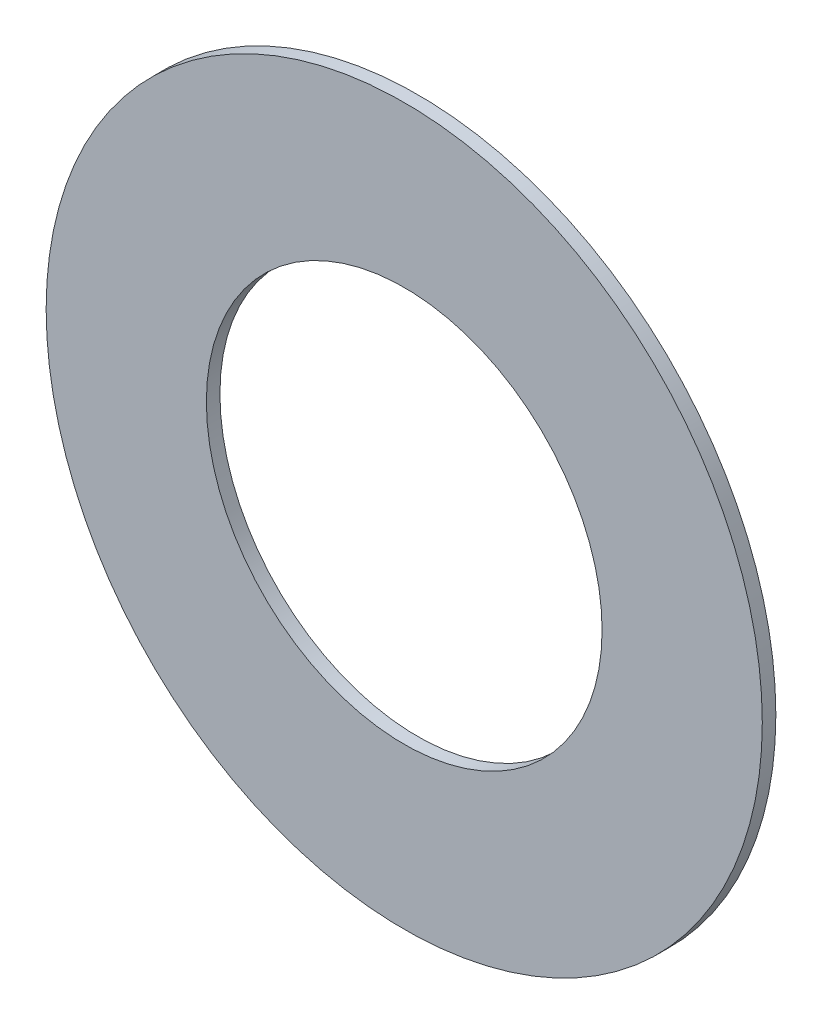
ISO-10303-21;
HEADER;
FILE_DESCRIPTION(('STEP AP214'),'2;1');
FILE_NAME('part.step','',(''),(''),'','','');
FILE_SCHEMA(('AUTOMOTIVE_DESIGN { 1 0 10303 214 1 1 1 1 }'));
ENDSEC;
DATA;
#1=APPLICATION_CONTEXT('core data for automotive mechanical design processes');
#2=APPLICATION_PROTOCOL_DEFINITION('international standard','automotive_design',2000,#1);
#3=PRODUCT_CONTEXT('',#1,'mechanical');
#4=PRODUCT('Part','Part','',(#3));
#5=PRODUCT_RELATED_PRODUCT_CATEGORY('part','',(#4));
#6=PRODUCT_DEFINITION_FORMATION('','',#4);
#7=PRODUCT_DEFINITION_CONTEXT('part definition',#1,'design');
#8=PRODUCT_DEFINITION('design','',#6,#7);
#9=PRODUCT_DEFINITION_SHAPE('','',#8);
#10=(LENGTH_UNIT() NAMED_UNIT(*) SI_UNIT(.MILLI.,.METRE.));
#11=(NAMED_UNIT(*) PLANE_ANGLE_UNIT() SI_UNIT($,.RADIAN.));
#12=(NAMED_UNIT(*) SI_UNIT($,.STERADIAN.) SOLID_ANGLE_UNIT());
#13=UNCERTAINTY_MEASURE_WITH_UNIT(LENGTH_MEASURE(1.E-05),#10,'distance_accuracy_value','');
#14=(GEOMETRIC_REPRESENTATION_CONTEXT(3) GLOBAL_UNCERTAINTY_ASSIGNED_CONTEXT((#13)) GLOBAL_UNIT_ASSIGNED_CONTEXT((#10,
#11,#12)) REPRESENTATION_CONTEXT('',''));
#15=CARTESIAN_POINT('',(0.,0.,0.));
#16=DIRECTION('',(0.,0.,1.));
#17=DIRECTION('',(1.,0.,0.));
#18=AXIS2_PLACEMENT_3D('',#15,#16,#17);
#19=CARTESIAN_POINT('',(0.,0.,1.5875));
#20=DIRECTION('',(0.,0.,1.));
#21=DIRECTION('',(1.,0.,0.));
#22=AXIS2_PLACEMENT_3D('',#19,#20,#21);
#23=PLANE('',#22);
#24=CARTESIAN_POINT('',(0.,0.,1.5875));
#25=DIRECTION('',(0.,0.,1.));
#26=DIRECTION('',(1.,0.,0.));
#27=AXIS2_PLACEMENT_3D('',#24,#25,#26);
#28=CIRCLE('',#27,83.8895845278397);
#29=CARTESIAN_POINT('',(83.8895845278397,0.,1.5875));
#30=VERTEX_POINT('',#29);
#31=EDGE_CURVE('E10',#30,#30,#28,.T.);
#32=ORIENTED_EDGE('',*,*,#31,.T.);
#33=EDGE_LOOP('',(#32));
#34=FACE_BOUND('',#33,.T.);
#35=CARTESIAN_POINT('',(0.,0.,1.5875));
#36=DIRECTION('',(0.,0.,1.));
#37=DIRECTION('',(1.,0.,0.));
#38=AXIS2_PLACEMENT_3D('',#35,#36,#37);
#39=CIRCLE('',#38,46.355);
#40=CARTESIAN_POINT('',(46.355,0.,1.5875));
#41=VERTEX_POINT('',#40);
#42=EDGE_CURVE('E57',#41,#41,#39,.T.);
#43=ORIENTED_EDGE('',*,*,#42,.F.);
#44=EDGE_LOOP('',(#43));
#45=FACE_BOUND('',#44,.T.);
#46=ADVANCED_FACE('F43',(#34,#45),#23,.T.);
#47=CARTESIAN_POINT('',(0.,0.,-1.5875));
#48=DIRECTION('',(0.,0.,1.));
#49=DIRECTION('',(1.,0.,0.));
#50=AXIS2_PLACEMENT_3D('',#47,#48,#49);
#51=PLANE('',#50);
#52=CARTESIAN_POINT('',(0.,0.,-1.5875));
#53=DIRECTION('',(0.,0.,1.));
#54=DIRECTION('',(1.,0.,0.));
#55=AXIS2_PLACEMENT_3D('',#52,#53,#54);
#56=CIRCLE('',#55,83.8895845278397);
#57=CARTESIAN_POINT('',(83.8895845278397,0.,-1.5875));
#58=VERTEX_POINT('',#57);
#59=EDGE_CURVE('E50',#58,#58,#56,.T.);
#60=ORIENTED_EDGE('',*,*,#59,.F.);
#61=EDGE_LOOP('',(#60));
#62=FACE_BOUND('',#61,.T.);
#63=CARTESIAN_POINT('',(0.,0.,-1.5875));
#64=DIRECTION('',(0.,0.,1.));
#65=DIRECTION('',(1.,0.,0.));
#66=AXIS2_PLACEMENT_3D('',#63,#64,#65);
#67=CIRCLE('',#66,46.355);
#68=CARTESIAN_POINT('',(46.355,0.,-1.5875));
#69=VERTEX_POINT('',#68);
#70=EDGE_CURVE('E59',#69,#69,#67,.T.);
#71=ORIENTED_EDGE('',*,*,#70,.T.);
#72=EDGE_LOOP('',(#71));
#73=FACE_BOUND('',#72,.T.);
#74=ADVANCED_FACE('F67',(#62,#73),#51,.F.);
#75=CARTESIAN_POINT('',(0.,0.,1.5875));
#76=DIRECTION('',(0.,0.,-1.));
#77=DIRECTION('',(-1.,0.,0.));
#78=AXIS2_PLACEMENT_3D('',#75,#76,#77);
#79=CYLINDRICAL_SURFACE('',#78,83.8895845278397);
#80=ORIENTED_EDGE('',*,*,#31,.F.);
#81=EDGE_LOOP('',(#80));
#82=FACE_BOUND('',#81,.T.);
#83=ORIENTED_EDGE('',*,*,#59,.T.);
#84=EDGE_LOOP('',(#83));
#85=FACE_BOUND('',#84,.T.);
#86=ADVANCED_FACE('F44',(#82,#85),#79,.T.);
#87=CARTESIAN_POINT('',(0.,0.,1.5875));
#88=DIRECTION('',(0.,0.,-1.));
#89=DIRECTION('',(-1.,0.,0.));
#90=AXIS2_PLACEMENT_3D('',#87,#88,#89);
#91=CYLINDRICAL_SURFACE('',#90,46.355);
#92=ORIENTED_EDGE('',*,*,#42,.T.);
#93=EDGE_LOOP('',(#92));
#94=FACE_BOUND('',#93,.T.);
#95=ORIENTED_EDGE('',*,*,#70,.F.);
#96=EDGE_LOOP('',(#95));
#97=FACE_BOUND('',#96,.T.);
#98=ADVANCED_FACE('F68',(#94,#97),#91,.F.);
#99=CLOSED_SHELL('',(#46,#74,#86,#98));
#100=MANIFOLD_SOLID_BREP('B2',#99);
#101=ADVANCED_BREP_SHAPE_REPRESENTATION('',(#18,#100),#14);
#102=SHAPE_DEFINITION_REPRESENTATION(#9,#101);
ENDSEC;
END-ISO-10303-21;
